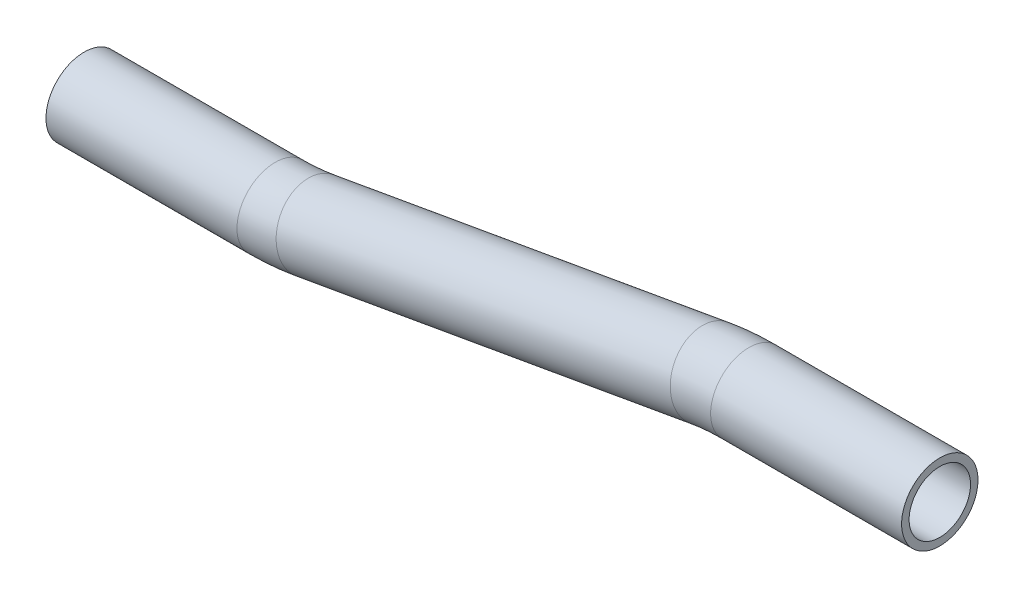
from build123d import *

# Parameters (mm, degrees)
SKETCH1_R   = 6.35
SKETCH1_R_2 = 5.1054


with BuildPart() as part:
    # Sweep1: sweep along a path in Sketch2
    with BuildLine(Plane.XY) as sweep1_path:
        Line((0, 0), (31.75, 0))
        ThreePointArc((31.75, 0), (35.068251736, 0.144773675), (38.36128586, 0.577994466))
        Line((38.36128586, 0.577994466), (103.87871414, 12.122005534))
        ThreePointArc((103.87871414, 12.122005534), (107.171748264, 12.555226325), (110.49, 12.7))
        Line((110.49, 12.7), (142.24, 12.7))
    # Sketch1 → Sweep1 (sweep)
    with BuildSketch(Plane(origin=(0, 0, 0), x_dir=(0, 0, -1), z_dir=(1, 0, 0))):
        Circle(SKETCH1_R)
        Circle(SKETCH1_R_2, mode=Mode.SUBTRACT)
    sweep(path=sweep1_path.line)


solid = part.part
